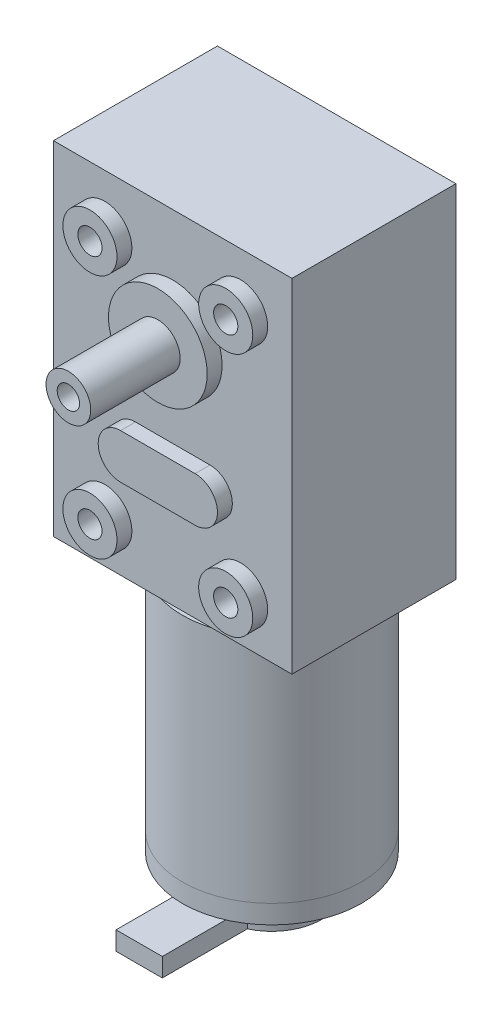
from build123d import *

# Parameters (mm, degrees)
SKETCH1_W                = 32
SKETCH1_H                = 46
SKETCH1_R                = 3.63
BOSS_EXTRUDE1_DEPTH      = 22
BOSS_EXTRUDE2_DEPTH      = 2
BOSS_EXTRUDE2_DEPTH_BACK = 22
SKETCH1_3_R              = 3.63
SKETCH1_3_R_2            = 1.625
SKETCH1_4_R              = 3
SKETCH1_4_R_2            = 1.5
BOSS_EXTRUDE3_DEPTH      = 14
SKETCH1_5_R              = 6.62
SKETCH1_5_R_2            = 3
BOSS_EXTRUDE4_DEPTH      = 2
CUT_EXTRUDE1_START       = -12
SKETCH1_6_R              = 1.625
SKETCH1_6_R_2            = 1.5
CUT_EXTRUDE1_DEPTH       = 12
CUT_EXTRUDE2_DEPTH       = 12
CUT_EXTRUDE2_DEPTH_BACK  = 12
SKETCH1_7_R              = 1.625
SKETCH2_R                = 12
BOSS_EXTRUDE5_DEPTH      = 31
SKETCH3_R                = 12
BOSS_EXTRUDE6_DEPTH      = 2.5
SKETCH4_R                = 6.7
BOSS_EXTRUDE7_DEPTH      = 4.5
SKETCH5_W                = 1.6
SKETCH5_H                = 2.5
SKETCH5_W_2              = 1.2
SKETCH5_W_3              = 1
CUT_EXTRUDE4_DEPTH       = 6
BOSS_EXTRUDE9_DEPTH      = 6
BOSS_EXTRUDE9_DEPTH_BACK = 6
SKETCH5_4_W              = 1.2
SKETCH5_4_H              = 2.5
SKETCH5_4_W_2            = 1
SKETCH5_4_W_3            = 1.6


with BuildPart() as part:
    # Sketch1 → Boss-Extrude1 (new body)
    with BuildSketch(Plane.XY):
        Rectangle(SKETCH1_W, SKETCH1_H)
        with Locations((9.11, 15.77)):
            Circle(SKETCH1_R, mode=Mode.SUBTRACT)
        with BuildLine():
            Line((-5, -4.1875), (5, -4.1875))
            ThreePointArc((5, -4.1875), (8, -7.1875), (5, -10.1875))
            Line((5, -10.1875), (-5, -10.1875))
            ThreePointArc((-5, -10.1875), (-8, -7.1875), (-5, -4.1875))
        make_face(mode=Mode.SUBTRACT)
    extrude(amount=-BOSS_EXTRUDE1_DEPTH)

    # Sketch1_3 → Boss-Extrude2 (add, two sides: drawn at the far end of the back side and taken through both)
    # profile 1 of 5: a face of its own
    with BuildSketch(Plane.XY.offset(-BOSS_EXTRUDE2_DEPTH_BACK)):
        with Locations((9.11, 15.77)):
            Circle(SKETCH1_3_R)
    # profile 2 of 5: a face of its own
    with BuildSketch(Plane.XY.offset(-BOSS_EXTRUDE2_DEPTH_BACK)):
        with Locations((9.11, -17.13)):
            Circle(SKETCH1_3_R)
        with Locations((9.11, -17.13)):
            Circle(SKETCH1_3_R_2, mode=Mode.SUBTRACT)
    # profile 3 of 5: a face of its own
    with BuildSketch(Plane.XY.offset(-BOSS_EXTRUDE2_DEPTH_BACK)):
        with Locations((-9.11, -17.13)):
            Circle(SKETCH1_3_R)
        with Locations((-9.11, -17.13)):
            Circle(SKETCH1_3_R_2, mode=Mode.SUBTRACT)
    # profile 4 of 5: a face of its own
    with BuildSketch(Plane.XY.offset(-BOSS_EXTRUDE2_DEPTH_BACK)):
        with Locations((-9.11, 15.77)):
            Circle(SKETCH1_3_R)
        with Locations((-9.11, 15.77)):
            Circle(SKETCH1_3_R_2, mode=Mode.SUBTRACT)
    # profile 5 of 5: a face of its own
    with BuildSketch(Plane.XY.offset(-BOSS_EXTRUDE2_DEPTH_BACK)):
        with BuildLine():
            Line((-5, -4.1875), (5, -4.1875))
            ThreePointArc((5, -4.1875), (8, -7.1875), (5, -10.1875))
            Line((5, -10.1875), (-5, -10.1875))
            ThreePointArc((-5, -10.1875), (-8, -7.1875), (-5, -4.1875))
        make_face()
    extrude(amount=BOSS_EXTRUDE2_DEPTH + BOSS_EXTRUDE2_DEPTH_BACK)

    # Sketch1_4 → Boss-Extrude3 (add)
    with BuildSketch(Plane.XY):
        with Locations((0, 8.2)):
            Circle(SKETCH1_4_R)
        with Locations((0, 8.2)):
            Circle(SKETCH1_4_R_2, mode=Mode.SUBTRACT)
    extrude(amount=BOSS_EXTRUDE3_DEPTH)

    # Sketch1_5 → Boss-Extrude4 (add)
    with BuildSketch(Plane.XY):
        with Locations((0, 8.2)):
            Circle(SKETCH1_5_R)
        with Locations((0, 8.2)):
            Circle(SKETCH1_5_R_2, mode=Mode.SUBTRACT)
    extrude(amount=BOSS_EXTRUDE4_DEPTH)

    # Sketch1_6 → Cut-Extrude1 (cut)
    with BuildSketch(Plane.XY.offset(CUT_EXTRUDE1_START)):
        with Locations((-9.11, 15.77)):
            Circle(SKETCH1_6_R)
        with Locations((0, 8.2)):
            Circle(SKETCH1_6_R_2)
        with Locations((-9.11, -17.13)):
            Circle(SKETCH1_6_R)
        with Locations((9.11, -17.13)):
            Circle(SKETCH1_6_R)
        with Locations((9.11, 15.77)):
            Circle(SKETCH1_6_R)
    extrude(amount=CUT_EXTRUDE1_DEPTH, mode=Mode.SUBTRACT)

    # Sketch1_7 → Cut-Extrude2 (cut, two sides: drawn at the far end of the back side and taken through both)
    with BuildSketch(Plane.XY.offset(-CUT_EXTRUDE2_DEPTH_BACK)):
        with Locations((9.11, 15.77)):
            Circle(SKETCH1_7_R)
    extrude(amount=CUT_EXTRUDE2_DEPTH + CUT_EXTRUDE2_DEPTH_BACK, mode=Mode.SUBTRACT)


with BuildPart() as body_2:
    # Sketch2 → Boss-Extrude5 (new body)
    with BuildSketch(Plane.XZ.offset(23)):
        with Locations(Location((1.8, -11.5, 0), (0, 0, 270))):
            Circle(SKETCH2_R)
    extrude(amount=BOSS_EXTRUDE5_DEPTH)


with BuildPart() as body_3:
    # Sketch3 → Boss-Extrude6 (new body)
    with BuildSketch(Plane.XZ.offset(54)):
        with Locations(Location((1.8, -11.5, 0), (0, 0, 270))):
            Circle(SKETCH3_R)
    extrude(amount=BOSS_EXTRUDE6_DEPTH)


with BuildPart() as body_4:
    # Sketch4 → Boss-Extrude7 (new body)
    with BuildSketch(Plane.XZ.offset(56.5)):
        with Locations(Location((1.8, -11.5, 0), (0, 0, 270))):
            Circle(SKETCH4_R)
    extrude(amount=BOSS_EXTRUDE7_DEPTH)

    # Sketch5 → Cut-Extrude4 (cut)
    with BuildSketch(Plane.XY):
        with Locations((3.8, -59.75)):
            Rectangle(SKETCH5_W, SKETCH5_H)
        with Locations((2.4, -59.75)):
            Rectangle(SKETCH5_W_2, SKETCH5_H)
        with Locations((1.3, -59.75)):
            Rectangle(SKETCH5_W_3, SKETCH5_H)
        with Locations((0.2, -59.75)):
            Rectangle(SKETCH5_W_2, SKETCH5_H)
        with Locations((-1, -59.75)):
            Rectangle(SKETCH5_W_2, SKETCH5_H)
    extrude(amount=-CUT_EXTRUDE4_DEPTH, mode=Mode.SUBTRACT)


with BuildPart() as body_5:
    # Sketch5_4 → Boss-Extrude9 (new, two sides: drawn at the far end of the back side and taken through both)
    with BuildSketch(Plane.XY.offset(-BOSS_EXTRUDE9_DEPTH_BACK)):
        with Locations((-1, -59.75)):
            Rectangle(SKETCH5_4_W, SKETCH5_4_H)
        with Locations((0.2, -59.75)):
            Rectangle(SKETCH5_4_W, SKETCH5_4_H)
        with Locations((1.3, -59.75)):
            Rectangle(SKETCH5_4_W_2, SKETCH5_4_H)
        with Locations((2.4, -59.75)):
            Rectangle(SKETCH5_4_W, SKETCH5_4_H)
        with Locations((3.8, -59.75)):
            Rectangle(SKETCH5_4_W_3, SKETCH5_4_H)
    extrude(amount=BOSS_EXTRUDE9_DEPTH + BOSS_EXTRUDE9_DEPTH_BACK)


solid = Compound([part.part, body_2.part, body_3.part, body_4.part, body_5.part])
